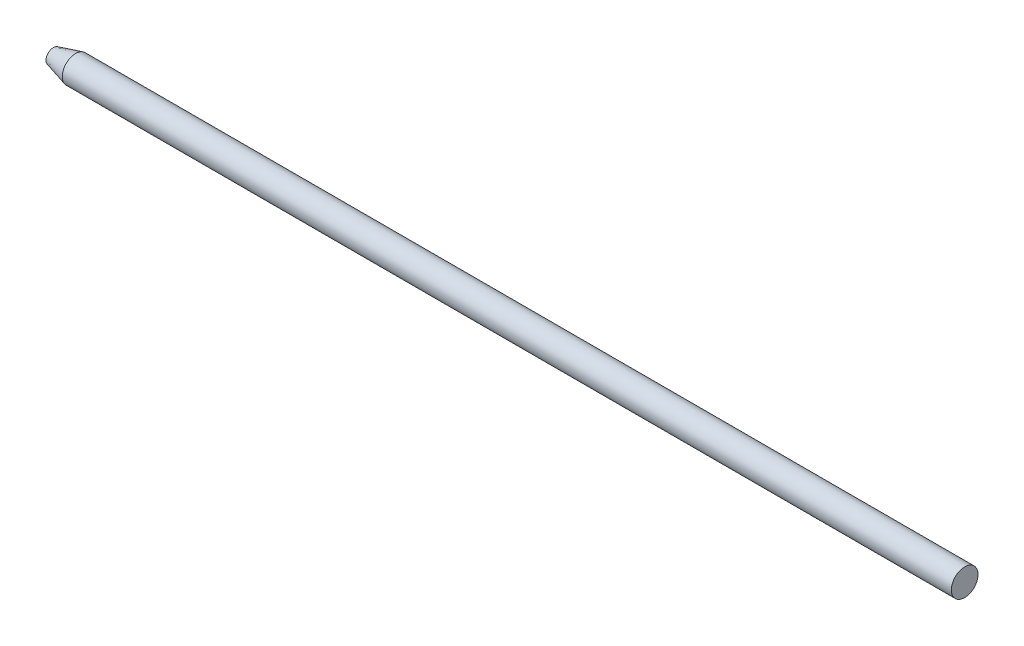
from build123d import *


with BuildPart() as part:
    # Skizze1 → Rotation1 (revolve)
    with BuildSketch(Plane.XY, mode=Mode.PRIVATE) as rotation1_sk:
        Polygon((0, 0), (0, 1.660254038), (5, 3), (205, 3), (205, 0), align=None)
    revolve(rotation1_sk.sketch.rotate(Axis((0, 0, 0), (1, 0, 0)), 90), axis=Axis((0, 0, 0), (1, 0, 0)))


solid = part.part
